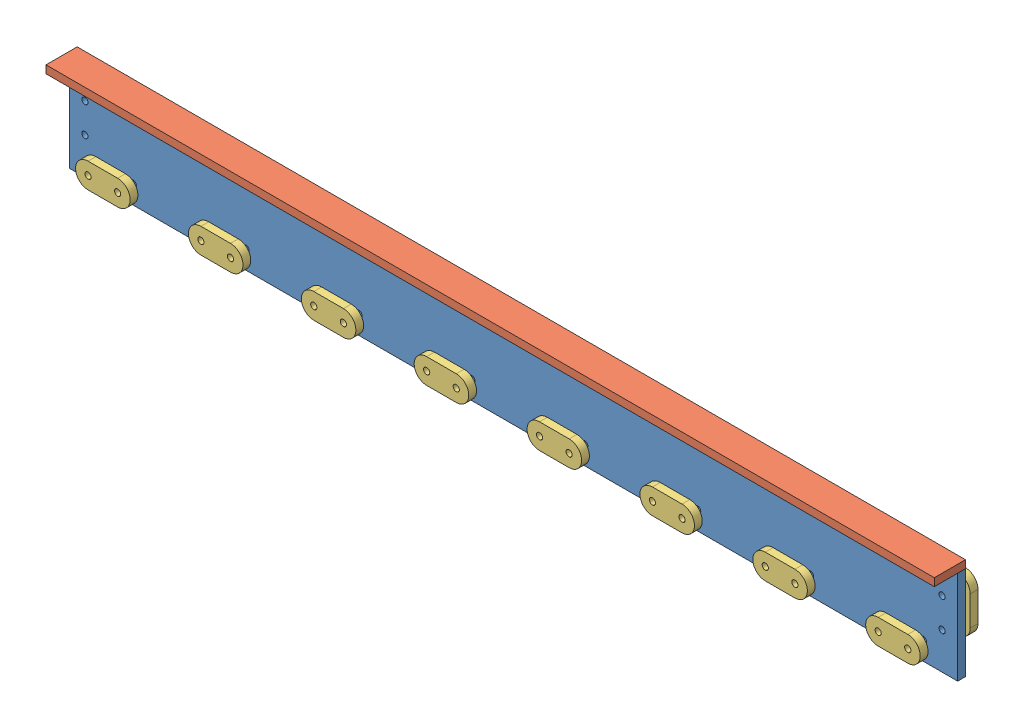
SolidWorks assembly fs-ua-left-mount-assembly.SLDASM, configuration Default (file format 9000). Lengths in mm.
Overall size (723.9 82.55 38.15).
12 component instances, 3 part files, 8 mates.
Components (placement in the parent):
- fs-ua-left-mount-vertical-component-1: fs-ua-left-mount-vertical-component.SLDPRT [Default] at origin size (723.9 76.2 6.35)
- fs-ua-left-mount-horizontal-component-1: fs-ua-left-mount-horizontal-component.SLDPRT [Default] at (361.95 76.2 12.7) size (723.9 6.35 25.4)
- fs-clamp-1: fs-clamp.SLDPRT [Default] at (27.94 15.24 12.7326) size (44.45 20.32 6.35)
- fs-clamp-2: fs-clamp.SLDPRT [Default] at (12.7 29.845 -12.7409) x (0 1 0) z (0 0 1) size (44.45 20.32 6.35)
- fs-clamp-3: fs-clamp.SLDPRT [Default] at (711.2 29.845 -6.3972) x (0 1 0) z (0 0 -1) size (44.45 20.32 6.35)
- fs-clamp-4: fs-clamp.SLDPRT [Default] at (119.9243 15.24 12.7326) size (44.45 20.32 6.35)
- fs-clamp-5: fs-clamp.SLDPRT [Default] at (211.9086 15.24 12.7326) size (44.45 20.32 6.35)
- fs-clamp-6: fs-clamp.SLDPRT [Default] at (303.893 15.24 12.7326) size (44.45 20.32 6.35)
- fs-clamp-7: fs-clamp.SLDPRT [Default] at (395.8773 15.24 12.7326) size (44.45 20.32 6.35)
- fs-clamp-8: fs-clamp.SLDPRT [Default] at (487.8616 15.24 12.7326) size (44.45 20.32 6.35)
- fs-clamp-9: fs-clamp.SLDPRT [Default] at (579.8459 15.24 12.7326) size (44.45 20.32 6.35)
- fs-clamp-10: fs-clamp.SLDPRT [Default] at (671.8303 15.24 12.7326) size (44.45 20.32 6.35)
Mates (geometry in assembly coordinates):
- Coincident1: coincident aligned: line of fs-ua-left-mount-vertical-component-1 through (723.9 723.9 76.2) axis (0 -1 0); line of fs-ua-left-mount-horizontal-component-1 through (723.9 723.9 76.2) axis (0 -1 0)
- Coincident2: coincident anti-aligned: line of fs-ua-left-mount-vertical-component-1 through (0 76.2 6.35) axis (0 0 -1); line of fs-ua-left-mount-horizontal-component-1 through (0 76.2 0) axis (0 0 1)
- Concentric1: concentric anti-aligned: cylinder of fs-ua-left-mount-vertical-component-1 through (27.94 15.24 -7.1842) axis (0 0 1) radius 2.54; cylinder of fs-clamp-1 through (27.94 15.24 19.0826) axis (0 0 -1) radius 2.54
- Concentric2: concentric anti-aligned: cylinder of fs-ua-left-mount-vertical-component-1 through (52.07 15.24 -7.1842) axis (0 0 1) radius 2.54; cylinder of fs-clamp-1 through (52.07 15.24 19.0826) axis (0 0 -1) radius 2.54
- Concentric3: concentric anti-aligned: cylinder of fs-ua-left-mount-vertical-component-1 through (12.7 29.845 -7.1842) axis (0 0 1) radius 2.54; cylinder of fs-clamp-2 through (12.7 29.845 -6.3909) axis (0 0 -1) radius 2.54
- Concentric4: concentric anti-aligned: cylinder of fs-ua-left-mount-vertical-component-1 through (12.7 53.975 -7.1842) axis (0 0 1) radius 2.54; cylinder of fs-clamp-2 through (12.7 53.975 -6.3909) axis (0 0 -1) radius 2.54
- Concentric5: concentric aligned: cylinder of fs-ua-left-mount-vertical-component-1 through (711.2 53.975 -7.1842) axis (0 0 1) radius 2.54; cylinder of fs-clamp-3 through (711.2 53.975 -12.7472) axis (0 0 1) radius 2.54
- Concentric6: concentric aligned: cylinder of fs-ua-left-mount-vertical-component-1 through (711.2 29.845 -7.1842) axis (0 0 1) radius 2.54; cylinder of fs-clamp-3 through (711.2 29.845 -12.7472) axis (0 0 1) radius 2.54
